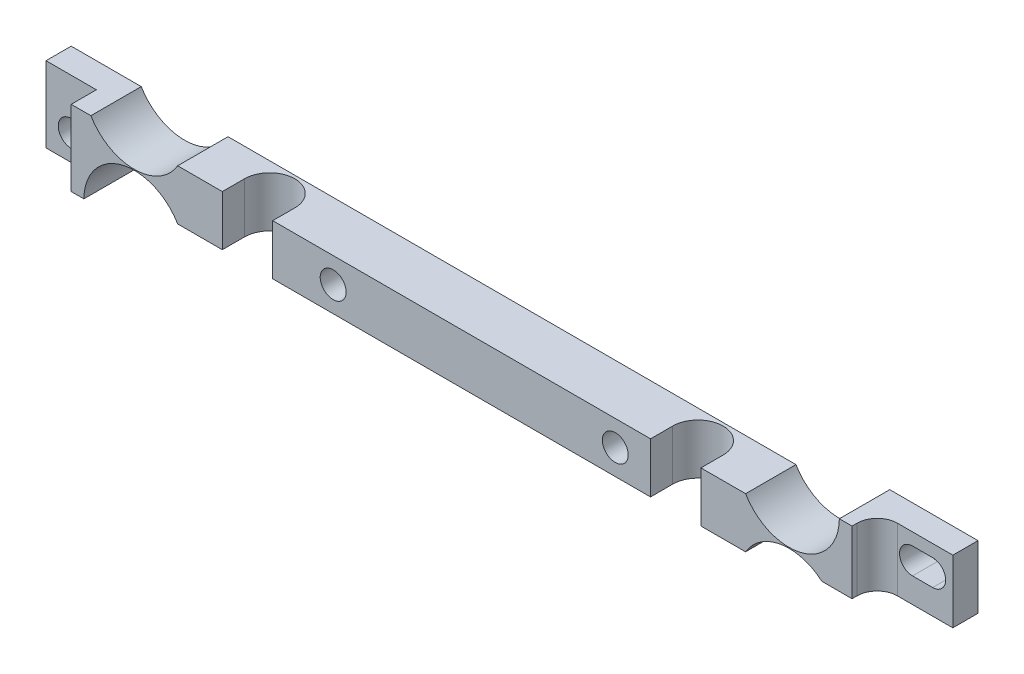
ISO-10303-21;
HEADER;
FILE_DESCRIPTION(('STEP AP214'),'2;1');
FILE_NAME('part.step','',(''),(''),'','','');
FILE_SCHEMA(('AUTOMOTIVE_DESIGN { 1 0 10303 214 1 1 1 1 }'));
ENDSEC;
DATA;
#1=APPLICATION_CONTEXT('core data for automotive mechanical design processes');
#2=APPLICATION_PROTOCOL_DEFINITION('international standard','automotive_design',2000,#1);
#3=PRODUCT_CONTEXT('',#1,'mechanical');
#4=PRODUCT('Part','Part','',(#3));
#5=PRODUCT_RELATED_PRODUCT_CATEGORY('part','',(#4));
#6=PRODUCT_DEFINITION_FORMATION('','',#4);
#7=PRODUCT_DEFINITION_CONTEXT('part definition',#1,'design');
#8=PRODUCT_DEFINITION('design','',#6,#7);
#9=PRODUCT_DEFINITION_SHAPE('','',#8);
#10=(LENGTH_UNIT() NAMED_UNIT(*) SI_UNIT(.MILLI.,.METRE.));
#11=(NAMED_UNIT(*) PLANE_ANGLE_UNIT() SI_UNIT($,.RADIAN.));
#12=(NAMED_UNIT(*) SI_UNIT($,.STERADIAN.) SOLID_ANGLE_UNIT());
#13=UNCERTAINTY_MEASURE_WITH_UNIT(LENGTH_MEASURE(1.E-05),#10,'distance_accuracy_value','');
#14=(GEOMETRIC_REPRESENTATION_CONTEXT(3) GLOBAL_UNCERTAINTY_ASSIGNED_CONTEXT((#13)) GLOBAL_UNIT_ASSIGNED_CONTEXT((#10,
#11,#12)) REPRESENTATION_CONTEXT('',''));
#15=CARTESIAN_POINT('',(0.,0.,0.));
#16=DIRECTION('',(0.,0.,1.));
#17=DIRECTION('',(1.,0.,0.));
#18=AXIS2_PLACEMENT_3D('',#15,#16,#17);
#19=CARTESIAN_POINT('',(-32.4430669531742,6.35000000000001,6.35));
#20=DIRECTION('',(0.,0.,-1.));
#21=DIRECTION('',(-1.,0.,0.));
#22=AXIS2_PLACEMENT_3D('',#19,#20,#21);
#23=PLANE('',#22);
#24=DIRECTION('',(0.,-1.,0.));
#25=VECTOR('',#24,1.);
#26=CARTESIAN_POINT('',(85.725,12.7,6.35));
#27=LINE('',#26,#25);
#28=CARTESIAN_POINT('',(85.725,9.525,6.35));
#29=VERTEX_POINT('',#28);
#30=CARTESIAN_POINT('',(85.725,3.17499999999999,6.35));
#31=VERTEX_POINT('',#30);
#32=EDGE_CURVE('E248',#29,#31,#27,.T.);
#33=ORIENTED_EDGE('',*,*,#32,.T.);
#34=DIRECTION('',(1.,0.,0.));
#35=VECTOR('',#34,1.);
#36=CARTESIAN_POINT('',(-32.4430669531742,3.17499999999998,6.35));
#37=LINE('',#36,#35);
#38=CARTESIAN_POINT('',(91.3551826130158,3.175,6.35));
#39=VERTEX_POINT('',#38);
#40=EDGE_CURVE('E336',#31,#39,#37,.T.);
#41=ORIENTED_EDGE('',*,*,#40,.T.);
#42=CARTESIAN_POINT('',(96.8248,-0.0508000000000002,6.35));
#43=DIRECTION('',(0.,0.,-1.));
#44=DIRECTION('',(-1.,0.,0.));
#45=AXIS2_PLACEMENT_3D('',#42,#43,#44);
#46=CIRCLE('',#45,6.35);
#47=CARTESIAN_POINT('',(100.966616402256,4.7625,6.35));
#48=VERTEX_POINT('',#47);
#49=EDGE_CURVE('E340',#39,#48,#46,.T.);
#50=ORIENTED_EDGE('',*,*,#49,.T.);
#51=DIRECTION('',(1.,0.,0.));
#52=VECTOR('',#51,1.);
#53=CARTESIAN_POINT('',(114.3,4.7625,6.35));
#54=LINE('',#53,#52);
#55=CARTESIAN_POINT('',(104.775,4.7625,6.35));
#56=VERTEX_POINT('',#55);
#57=EDGE_CURVE('E321',#48,#56,#54,.T.);
#58=ORIENTED_EDGE('',*,*,#57,.T.);
#59=DIRECTION('',(0.,-1.,0.));
#60=VECTOR('',#59,1.);
#61=CARTESIAN_POINT('',(104.775,12.7,6.35));
#62=LINE('',#61,#60);
#63=CARTESIAN_POINT('',(104.775,12.7,6.35));
#64=VERTEX_POINT('',#63);
#65=EDGE_CURVE('E278',#64,#56,#62,.T.);
#66=ORIENTED_EDGE('',*,*,#65,.F.);
#67=DIRECTION('',(1.,0.,0.));
#68=VECTOR('',#67,1.);
#69=CARTESIAN_POINT('',(-32.4430669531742,12.7,6.35));
#70=LINE('',#69,#68);
#71=CARTESIAN_POINT('',(103.174596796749,12.7,6.35));
#72=VERTEX_POINT('',#71);
#73=EDGE_CURVE('E344',#72,#64,#70,.T.);
#74=ORIENTED_EDGE('',*,*,#73,.F.);
#75=CARTESIAN_POINT('',(96.8248,12.7508,6.35));
#76=DIRECTION('',(0.,0.,-1.));
#77=DIRECTION('',(-1.,0.,0.));
#78=AXIS2_PLACEMENT_3D('',#75,#76,#77);
#79=CIRCLE('',#78,6.35);
#80=CARTESIAN_POINT('',(91.3551826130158,9.525,6.35));
#81=VERTEX_POINT('',#80);
#82=EDGE_CURVE('E347',#72,#81,#79,.T.);
#83=ORIENTED_EDGE('',*,*,#82,.T.);
#84=DIRECTION('',(1.,0.,0.));
#85=VECTOR('',#84,1.);
#86=CARTESIAN_POINT('',(-32.4430669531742,9.52499999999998,6.35));
#87=LINE('',#86,#85);
#88=EDGE_CURVE('E350',#29,#81,#87,.T.);
#89=ORIENTED_EDGE('',*,*,#88,.F.);
#90=EDGE_LOOP('',(#33,#41,#50,#58,#66,#74,#83,#89));
#91=FACE_BOUND('',#90,.T.);
#92=ADVANCED_FACE('F30',(#91),#23,.F.);
#93=CARTESIAN_POINT('',(74.93,6.35,6.35));
#94=DIRECTION('',(0.,0.,1.));
#95=DIRECTION('',(1.,0.,0.));
#96=AXIS2_PLACEMENT_3D('',#93,#94,#95);
#97=CIRCLE('',#96,1.63194999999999);
#98=CARTESIAN_POINT('',(76.56195,6.35,6.35));
#99=VERTEX_POINT('',#98);
#100=EDGE_CURVE('E828',#99,#99,#97,.T.);
#101=ORIENTED_EDGE('',*,*,#100,.F.);
#102=EDGE_LOOP('',(#101));
#103=FACE_BOUND('',#102,.T.);
#104=CARTESIAN_POINT('',(39.37,6.35,6.35));
#105=DIRECTION('',(0.,0.,1.));
#106=DIRECTION('',(1.,0.,0.));
#107=AXIS2_PLACEMENT_3D('',#104,#105,#106);
#108=CIRCLE('',#107,1.63195);
#109=CARTESIAN_POINT('',(41.00195,6.35,6.35));
#110=VERTEX_POINT('',#109);
#111=EDGE_CURVE('E830',#110,#110,#108,.T.);
#112=ORIENTED_EDGE('',*,*,#111,.F.);
#113=EDGE_LOOP('',(#112));
#114=FACE_BOUND('',#113,.T.);
#115=CARTESIAN_POINT('',(31.75,3.17499999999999,6.35));
#116=VERTEX_POINT('',#115);
#117=CARTESIAN_POINT('',(79.375,3.17499999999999,6.35));
#118=VERTEX_POINT('',#117);
#119=EDGE_CURVE('E341',#116,#118,#37,.T.);
#120=ORIENTED_EDGE('',*,*,#119,.T.);
#121=DIRECTION('',(0.,-1.,0.));
#122=VECTOR('',#121,1.);
#123=CARTESIAN_POINT('',(79.375,12.7,6.35));
#124=LINE('',#123,#122);
#125=CARTESIAN_POINT('',(79.375,9.525,6.35));
#126=VERTEX_POINT('',#125);
#127=EDGE_CURVE('E234',#126,#118,#124,.T.);
#128=ORIENTED_EDGE('',*,*,#127,.F.);
#129=CARTESIAN_POINT('',(31.75,9.52499999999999,6.35));
#130=VERTEX_POINT('',#129);
#131=EDGE_CURVE('E355',#130,#126,#87,.T.);
#132=ORIENTED_EDGE('',*,*,#131,.F.);
#133=DIRECTION('',(0.,1.,0.));
#134=VECTOR('',#133,1.);
#135=CARTESIAN_POINT('',(31.75,6.35000000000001,6.35));
#136=LINE('',#135,#134);
#137=EDGE_CURVE('E440',#116,#130,#136,.T.);
#138=ORIENTED_EDGE('',*,*,#137,.F.);
#139=EDGE_LOOP('',(#120,#128,#132,#138));
#140=FACE_BOUND('',#139,.T.);
#141=ADVANCED_FACE('F462',(#103,#114,#140),#23,.F.);
#142=CARTESIAN_POINT('',(-32.4430669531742,7.89304999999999,6.35));
#143=DIRECTION('',(0.,-1.,0.));
#144=DIRECTION('',(0.,0.,-1.));
#145=AXIS2_PLACEMENT_3D('',#142,#143,#144);
#146=PLANE('',#145);
#147=DIRECTION('',(0.,0.,-1.));
#148=VECTOR('',#147,1.);
#149=CARTESIAN_POINT('',(109.22,7.89304999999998,6.35));
#150=LINE('',#149,#148);
#151=CARTESIAN_POINT('',(109.22,7.89304999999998,3.175));
#152=VERTEX_POINT('',#151);
#153=CARTESIAN_POINT('',(109.22,7.89304999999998,0.));
#154=VERTEX_POINT('',#153);
#155=EDGE_CURVE('E411',#152,#154,#150,.T.);
#156=ORIENTED_EDGE('',*,*,#155,.F.);
#157=DIRECTION('',(1.,0.,0.));
#158=VECTOR('',#157,1.);
#159=CARTESIAN_POINT('',(-32.4430669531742,7.89304999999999,3.17499999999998));
#160=LINE('',#159,#158);
#161=CARTESIAN_POINT('',(111.76,7.89304999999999,3.175));
#162=VERTEX_POINT('',#161);
#163=EDGE_CURVE('E302',#152,#162,#160,.T.);
#164=ORIENTED_EDGE('',*,*,#163,.T.);
#165=DIRECTION('',(0.,0.,-1.));
#166=VECTOR('',#165,1.);
#167=CARTESIAN_POINT('',(111.76,7.89304999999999,6.35));
#168=LINE('',#167,#166);
#169=CARTESIAN_POINT('',(111.76,7.89304999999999,0.));
#170=VERTEX_POINT('',#169);
#171=EDGE_CURVE('E404',#162,#170,#168,.T.);
#172=ORIENTED_EDGE('',*,*,#171,.T.);
#173=DIRECTION('',(-1.,0.,0.));
#174=VECTOR('',#173,1.);
#175=CARTESIAN_POINT('',(-32.4430669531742,7.89304999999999,0.));
#176=LINE('',#175,#174);
#177=EDGE_CURVE('E390',#170,#154,#176,.T.);
#178=ORIENTED_EDGE('',*,*,#177,.T.);
#179=EDGE_LOOP('',(#156,#164,#172,#178));
#180=FACE_BOUND('',#179,.T.);
#181=ADVANCED_FACE('F539',(#180),#146,.F.);
#182=CARTESIAN_POINT('',(109.22,9.52499999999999,6.35));
#183=DIRECTION('',(0.,0.,-1.));
#184=DIRECTION('',(-1.,0.,0.));
#185=AXIS2_PLACEMENT_3D('',#182,#183,#184);
#186=CYLINDRICAL_SURFACE('',#185,1.63195);
#187=DIRECTION('',(0.,0.,-1.));
#188=VECTOR('',#187,1.);
#189=CARTESIAN_POINT('',(109.22,11.15695,6.35));
#190=LINE('',#189,#188);
#191=CARTESIAN_POINT('',(109.22,11.15695,3.175));
#192=VERTEX_POINT('',#191);
#193=CARTESIAN_POINT('',(109.22,11.15695,0.));
#194=VERTEX_POINT('',#193);
#195=EDGE_CURVE('E409',#192,#194,#190,.T.);
#196=ORIENTED_EDGE('',*,*,#195,.F.);
#197=CARTESIAN_POINT('',(109.22,9.52499999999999,3.175));
#198=DIRECTION('',(0.,0.,-1.));
#199=DIRECTION('',(-1.,0.,0.));
#200=AXIS2_PLACEMENT_3D('',#197,#198,#199);
#201=CIRCLE('',#200,1.63195);
#202=EDGE_CURVE('E299',#192,#152,#201,.F.);
#203=ORIENTED_EDGE('',*,*,#202,.T.);
#204=ORIENTED_EDGE('',*,*,#155,.T.);
#205=CARTESIAN_POINT('',(109.22,9.52499999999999,0.));
#206=DIRECTION('',(0.,0.,-1.));
#207=DIRECTION('',(-1.,0.,0.));
#208=AXIS2_PLACEMENT_3D('',#205,#206,#207);
#209=CIRCLE('',#208,1.63195);
#210=EDGE_CURVE('E393',#154,#194,#209,.T.);
#211=ORIENTED_EDGE('',*,*,#210,.T.);
#212=EDGE_LOOP('',(#196,#203,#204,#211));
#213=FACE_BOUND('',#212,.T.);
#214=ADVANCED_FACE('F567',(#213),#186,.F.);
#215=CARTESIAN_POINT('',(-32.4430669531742,11.1569499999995,6.35));
#216=DIRECTION('',(0.,1.,0.));
#217=DIRECTION('',(-1.,0.,0.));
#218=AXIS2_PLACEMENT_3D('',#215,#216,#217);
#219=PLANE('',#218);
#220=DIRECTION('',(0.,0.,-1.));
#221=VECTOR('',#220,1.);
#222=CARTESIAN_POINT('',(111.76,11.15695,6.35));
#223=LINE('',#222,#221);
#224=CARTESIAN_POINT('',(111.76,11.15695,3.175));
#225=VERTEX_POINT('',#224);
#226=CARTESIAN_POINT('',(111.76,11.15695,0.));
#227=VERTEX_POINT('',#226);
#228=EDGE_CURVE('E406',#225,#227,#223,.T.);
#229=ORIENTED_EDGE('',*,*,#228,.F.);
#230=DIRECTION('',(-1.,0.,0.));
#231=VECTOR('',#230,1.);
#232=CARTESIAN_POINT('',(-32.4430669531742,11.1569499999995,3.17499999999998));
#233=LINE('',#232,#231);
#234=EDGE_CURVE('E296',#225,#192,#233,.T.);
#235=ORIENTED_EDGE('',*,*,#234,.T.);
#236=ORIENTED_EDGE('',*,*,#195,.T.);
#237=DIRECTION('',(1.,0.,0.));
#238=VECTOR('',#237,1.);
#239=CARTESIAN_POINT('',(-32.4430669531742,11.1569499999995,0.));
#240=LINE('',#239,#238);
#241=EDGE_CURVE('E396',#194,#227,#240,.T.);
#242=ORIENTED_EDGE('',*,*,#241,.T.);
#243=EDGE_LOOP('',(#229,#235,#236,#242));
#244=FACE_BOUND('',#243,.T.);
#245=ADVANCED_FACE('F564',(#244),#219,.F.);
#246=CARTESIAN_POINT('',(-32.4430669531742,0.,6.35));
#247=DIRECTION('',(0.,-1.,0.));
#248=DIRECTION('',(0.,0.,-1.));
#249=AXIS2_PLACEMENT_3D('',#246,#247,#248);
#250=PLANE('',#249);
#251=DIRECTION('',(0.,0.,1.));
#252=VECTOR('',#251,1.);
#253=CARTESIAN_POINT('',(6.35,0.,6.35));
#254=LINE('',#253,#252);
#255=CARTESIAN_POINT('',(6.35,0.,3.175));
#256=VERTEX_POINT('',#255);
#257=CARTESIAN_POINT('',(6.35,0.,6.35));
#258=VERTEX_POINT('',#257);
#259=EDGE_CURVE('E308',#256,#258,#254,.T.);
#260=ORIENTED_EDGE('',*,*,#259,.F.);
#261=DIRECTION('',(1.,0.,0.));
#262=VECTOR('',#261,1.);
#263=CARTESIAN_POINT('',(0.,0.,3.175));
#264=LINE('',#263,#262);
#265=CARTESIAN_POINT('',(0.,0.,3.175));
#266=VERTEX_POINT('',#265);
#267=EDGE_CURVE('E305',#266,#256,#264,.T.);
#268=ORIENTED_EDGE('',*,*,#267,.F.);
#269=DIRECTION('',(0.,0.,-1.));
#270=VECTOR('',#269,1.);
#271=CARTESIAN_POINT('',(0.,0.,6.35));
#272=LINE('',#271,#270);
#273=CARTESIAN_POINT('',(0.,0.,0.));
#274=VERTEX_POINT('',#273);
#275=EDGE_CURVE('E360',#266,#274,#272,.T.);
#276=ORIENTED_EDGE('',*,*,#275,.T.);
#277=DIRECTION('',(-1.,0.,0.));
#278=VECTOR('',#277,1.);
#279=CARTESIAN_POINT('',(-32.4430669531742,0.,0.));
#280=LINE('',#279,#278);
#281=CARTESIAN_POINT('',(7.9504032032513,0.,0.));
#282=VERTEX_POINT('',#281);
#283=EDGE_CURVE('E329',#282,#274,#280,.T.);
#284=ORIENTED_EDGE('',*,*,#283,.F.);
#285=DIRECTION('',(0.,0.,-1.));
#286=VECTOR('',#285,1.);
#287=CARTESIAN_POINT('',(7.9504032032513,0.,6.35));
#288=LINE('',#287,#286);
#289=CARTESIAN_POINT('',(7.9504032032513,0.,6.35));
#290=VERTEX_POINT('',#289);
#291=EDGE_CURVE('E407',#290,#282,#288,.T.);
#292=ORIENTED_EDGE('',*,*,#291,.F.);
#293=DIRECTION('',(-1.,0.,0.));
#294=VECTOR('',#293,1.);
#295=CARTESIAN_POINT('',(-32.4430669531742,0.,6.35));
#296=LINE('',#295,#294);
#297=EDGE_CURVE('E330',#290,#258,#296,.T.);
#298=ORIENTED_EDGE('',*,*,#297,.T.);
#299=EDGE_LOOP('',(#260,#268,#276,#284,#292,#298));
#300=FACE_BOUND('',#299,.T.);
#301=ADVANCED_FACE('F32',(#300),#250,.T.);
#302=CARTESIAN_POINT('',(14.3002,-0.0508000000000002,6.35));
#303=DIRECTION('',(0.,0.,-1.));
#304=DIRECTION('',(-1.,0.,0.));
#305=AXIS2_PLACEMENT_3D('',#302,#303,#304);
#306=CYLINDRICAL_SURFACE('',#305,6.35);
#307=CARTESIAN_POINT('',(14.3002,-0.0508000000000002,0.));
#308=DIRECTION('',(0.,0.,-1.));
#309=DIRECTION('',(-1.,0.,0.));
#310=AXIS2_PLACEMENT_3D('',#307,#308,#309);
#311=CIRCLE('',#310,6.35);
#312=CARTESIAN_POINT('',(19.7698173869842,3.17499999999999,0.));
#313=VERTEX_POINT('',#312);
#314=EDGE_CURVE('E363',#282,#313,#311,.T.);
#315=ORIENTED_EDGE('',*,*,#314,.T.);
#316=DIRECTION('',(0.,0.,-1.));
#317=VECTOR('',#316,1.);
#318=CARTESIAN_POINT('',(19.7698173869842,3.17499999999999,6.35));
#319=LINE('',#318,#317);
#320=CARTESIAN_POINT('',(19.7698173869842,3.17499999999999,6.35));
#321=VERTEX_POINT('',#320);
#322=EDGE_CURVE('E431',#321,#313,#319,.T.);
#323=ORIENTED_EDGE('',*,*,#322,.F.);
#324=CARTESIAN_POINT('',(14.3002,-0.0508000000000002,6.35));
#325=DIRECTION('',(0.,0.,-1.));
#326=DIRECTION('',(-1.,0.,0.));
#327=AXIS2_PLACEMENT_3D('',#324,#325,#326);
#328=CIRCLE('',#327,6.35);
#329=EDGE_CURVE('E333',#290,#321,#328,.T.);
#330=ORIENTED_EDGE('',*,*,#329,.F.);
#331=ORIENTED_EDGE('',*,*,#291,.T.);
#332=EDGE_LOOP('',(#315,#323,#330,#331));
#333=FACE_BOUND('',#332,.T.);
#334=ADVANCED_FACE('F589',(#333),#306,.F.);
#335=CARTESIAN_POINT('',(-32.4430669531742,3.17499999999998,6.35));
#336=DIRECTION('',(0.,1.,0.));
#337=DIRECTION('',(-1.,0.,0.));
#338=AXIS2_PLACEMENT_3D('',#335,#336,#337);
#339=PLANE('',#338);
#340=CARTESIAN_POINT('',(82.55,3.17499999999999,3.556));
#341=DIRECTION('',(0.,1.,0.));
#342=DIRECTION('',(0.,0.,1.));
#343=AXIS2_PLACEMENT_3D('',#340,#341,#342);
#344=CIRCLE('',#343,3.175);
#345=CARTESIAN_POINT('',(85.725,3.17499999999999,3.556));
#346=VERTEX_POINT('',#345);
#347=CARTESIAN_POINT('',(79.375,3.17499999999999,3.556));
#348=VERTEX_POINT('',#347);
#349=EDGE_CURVE('E222',#346,#348,#344,.T.);
#350=ORIENTED_EDGE('',*,*,#349,.T.);
#351=DIRECTION('',(0.,0.,-1.));
#352=VECTOR('',#351,1.);
#353=CARTESIAN_POINT('',(79.375,3.17499999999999,3.175));
#354=LINE('',#353,#352);
#355=EDGE_CURVE('E231',#118,#348,#354,.T.);
#356=ORIENTED_EDGE('',*,*,#355,.F.);
#357=ORIENTED_EDGE('',*,*,#119,.F.);
#358=DIRECTION('',(0.,0.,-1.));
#359=VECTOR('',#358,1.);
#360=CARTESIAN_POINT('',(31.75,3.17499999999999,3.175));
#361=LINE('',#360,#359);
#362=CARTESIAN_POINT('',(31.75,3.17499999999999,3.556));
#363=VERTEX_POINT('',#362);
#364=EDGE_CURVE('E53',#116,#363,#361,.T.);
#365=ORIENTED_EDGE('',*,*,#364,.T.);
#366=CARTESIAN_POINT('',(28.575,3.17499999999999,3.556));
#367=DIRECTION('',(0.,1.,0.));
#368=DIRECTION('',(0.,0.,1.));
#369=AXIS2_PLACEMENT_3D('',#366,#367,#368);
#370=CIRCLE('',#369,3.175);
#371=CARTESIAN_POINT('',(25.4,3.17499999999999,3.556));
#372=VERTEX_POINT('',#371);
#373=EDGE_CURVE('E254',#363,#372,#370,.T.);
#374=ORIENTED_EDGE('',*,*,#373,.T.);
#375=DIRECTION('',(0.,0.,-1.));
#376=VECTOR('',#375,1.);
#377=CARTESIAN_POINT('',(25.4,3.17499999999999,3.175));
#378=LINE('',#377,#376);
#379=CARTESIAN_POINT('',(25.4,3.17499999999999,6.35));
#380=VERTEX_POINT('',#379);
#381=EDGE_CURVE('E247',#380,#372,#378,.T.);
#382=ORIENTED_EDGE('',*,*,#381,.F.);
#383=EDGE_CURVE('E337',#321,#380,#37,.T.);
#384=ORIENTED_EDGE('',*,*,#383,.F.);
#385=ORIENTED_EDGE('',*,*,#322,.T.);
#386=DIRECTION('',(1.,0.,0.));
#387=VECTOR('',#386,1.);
#388=CARTESIAN_POINT('',(-32.4430669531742,3.17499999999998,0.));
#389=LINE('',#388,#387);
#390=CARTESIAN_POINT('',(91.3551826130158,3.175,0.));
#391=VERTEX_POINT('',#390);
#392=EDGE_CURVE('E365',#313,#391,#389,.T.);
#393=ORIENTED_EDGE('',*,*,#392,.T.);
#394=DIRECTION('',(0.,0.,-1.));
#395=VECTOR('',#394,1.);
#396=CARTESIAN_POINT('',(91.3551826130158,3.175,6.35));
#397=LINE('',#396,#395);
#398=EDGE_CURVE('E428',#39,#391,#397,.T.);
#399=ORIENTED_EDGE('',*,*,#398,.F.);
#400=ORIENTED_EDGE('',*,*,#40,.F.);
#401=DIRECTION('',(0.,0.,-1.));
#402=VECTOR('',#401,1.);
#403=CARTESIAN_POINT('',(85.725,3.17499999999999,3.175));
#404=LINE('',#403,#402);
#405=EDGE_CURVE('E228',#31,#346,#404,.T.);
#406=ORIENTED_EDGE('',*,*,#405,.T.);
#407=EDGE_LOOP('',(#350,#356,#357,#365,#374,#382,#384,#385,#393,#399,#400,#406));
#408=FACE_BOUND('',#407,.T.);
#409=ADVANCED_FACE('F240',(#408),#339,.F.);
#410=CARTESIAN_POINT('',(96.8248,-0.0508000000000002,6.35));
#411=DIRECTION('',(0.,0.,-1.));
#412=DIRECTION('',(-1.,0.,0.));
#413=AXIS2_PLACEMENT_3D('',#410,#411,#412);
#414=CYLINDRICAL_SURFACE('',#413,6.35);
#415=CARTESIAN_POINT('',(96.8248,-0.0508000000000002,0.));
#416=DIRECTION('',(0.,0.,-1.));
#417=DIRECTION('',(-1.,0.,0.));
#418=AXIS2_PLACEMENT_3D('',#415,#416,#417);
#419=CIRCLE('',#418,6.35);
#420=CARTESIAN_POINT('',(100.966616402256,4.7625,0.));
#421=VERTEX_POINT('',#420);
#422=EDGE_CURVE('E367',#391,#421,#419,.T.);
#423=ORIENTED_EDGE('',*,*,#422,.T.);
#424=DIRECTION('',(0.,0.,-1.));
#425=VECTOR('',#424,1.);
#426=CARTESIAN_POINT('',(100.966616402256,4.7625,6.35));
#427=LINE('',#426,#425);
#428=EDGE_CURVE('E326',#421,#48,#427,.F.);
#429=ORIENTED_EDGE('',*,*,#428,.T.);
#430=ORIENTED_EDGE('',*,*,#49,.F.);
#431=ORIENTED_EDGE('',*,*,#398,.T.);
#432=EDGE_LOOP('',(#423,#429,#430,#431));
#433=FACE_BOUND('',#432,.T.);
#434=ADVANCED_FACE('F468',(#433),#414,.F.);
#435=CARTESIAN_POINT('',(114.3,6.35000000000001,6.35));
#436=DIRECTION('',(-1.,0.,0.));
#437=DIRECTION('',(0.,0.,1.));
#438=AXIS2_PLACEMENT_3D('',#435,#436,#437);
#439=PLANE('',#438);
#440=DIRECTION('',(0.,0.,-1.));
#441=VECTOR('',#440,1.);
#442=CARTESIAN_POINT('',(114.3,12.7,6.35));
#443=LINE('',#442,#441);
#444=CARTESIAN_POINT('',(114.3,12.7,3.175));
#445=VERTEX_POINT('',#444);
#446=CARTESIAN_POINT('',(114.3,12.7,0.));
#447=VERTEX_POINT('',#446);
#448=EDGE_CURVE('E426',#445,#447,#443,.T.);
#449=ORIENTED_EDGE('',*,*,#448,.F.);
#450=DIRECTION('',(0.,-1.,0.));
#451=VECTOR('',#450,1.);
#452=CARTESIAN_POINT('',(114.3,12.7,3.175));
#453=LINE('',#452,#451);
#454=CARTESIAN_POINT('',(114.3,4.7625,3.175));
#455=VERTEX_POINT('',#454);
#456=EDGE_CURVE('E285',#445,#455,#453,.T.);
#457=ORIENTED_EDGE('',*,*,#456,.T.);
#458=DIRECTION('',(0.,0.,-1.));
#459=VECTOR('',#458,1.);
#460=CARTESIAN_POINT('',(114.3,4.7625,6.35));
#461=LINE('',#460,#459);
#462=CARTESIAN_POINT('',(114.3,4.7625,0.));
#463=VERTEX_POINT('',#462);
#464=EDGE_CURVE('E324',#455,#463,#461,.T.);
#465=ORIENTED_EDGE('',*,*,#464,.T.);
#466=DIRECTION('',(0.,1.,0.));
#467=VECTOR('',#466,1.);
#468=CARTESIAN_POINT('',(114.3,6.35000000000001,0.));
#469=LINE('',#468,#467);
#470=EDGE_CURVE('E370',#463,#447,#469,.T.);
#471=ORIENTED_EDGE('',*,*,#470,.T.);
#472=EDGE_LOOP('',(#449,#457,#465,#471));
#473=FACE_BOUND('',#472,.T.);
#474=ADVANCED_FACE('F482',(#473),#439,.F.);
#475=CARTESIAN_POINT('',(-32.4430669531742,12.7,6.35));
#476=DIRECTION('',(0.,1.,0.));
#477=DIRECTION('',(0.,0.,1.));
#478=AXIS2_PLACEMENT_3D('',#475,#476,#477);
#479=PLANE('',#478);
#480=DIRECTION('',(1.,0.,0.));
#481=VECTOR('',#480,1.);
#482=CARTESIAN_POINT('',(114.3,12.7,3.175));
#483=LINE('',#482,#481);
#484=CARTESIAN_POINT('',(107.315,12.7,3.175));
#485=VERTEX_POINT('',#484);
#486=EDGE_CURVE('E275',#485,#445,#483,.T.);
#487=ORIENTED_EDGE('',*,*,#486,.T.);
#488=ORIENTED_EDGE('',*,*,#448,.T.);
#489=DIRECTION('',(1.,0.,0.));
#490=VECTOR('',#489,1.);
#491=CARTESIAN_POINT('',(-32.4430669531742,12.7,0.));
#492=LINE('',#491,#490);
#493=CARTESIAN_POINT('',(103.174596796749,12.7,0.));
#494=VERTEX_POINT('',#493);
#495=EDGE_CURVE('E373',#494,#447,#492,.T.);
#496=ORIENTED_EDGE('',*,*,#495,.F.);
#497=DIRECTION('',(0.,0.,-1.));
#498=VECTOR('',#497,1.);
#499=CARTESIAN_POINT('',(103.174596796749,12.7,6.35));
#500=LINE('',#499,#498);
#501=EDGE_CURVE('E424',#72,#494,#500,.T.);
#502=ORIENTED_EDGE('',*,*,#501,.F.);
#503=ORIENTED_EDGE('',*,*,#73,.T.);
#504=DIRECTION('',(0.,0.,-1.));
#505=VECTOR('',#504,1.);
#506=CARTESIAN_POINT('',(104.775,12.7,6.35));
#507=LINE('',#506,#505);
#508=CARTESIAN_POINT('',(104.775,12.7,5.715));
#509=VERTEX_POINT('',#508);
#510=EDGE_CURVE('E268',#64,#509,#507,.T.);
#511=ORIENTED_EDGE('',*,*,#510,.T.);
#512=CARTESIAN_POINT('',(107.315,12.7,5.715));
#513=DIRECTION('',(0.,-1.,0.));
#514=DIRECTION('',(0.,0.,1.));
#515=AXIS2_PLACEMENT_3D('',#512,#513,#514);
#516=CIRCLE('',#515,2.54);
#517=EDGE_CURVE('E271',#509,#485,#516,.T.);
#518=ORIENTED_EDGE('',*,*,#517,.T.);
#519=EDGE_LOOP('',(#487,#488,#496,#502,#503,#511,#518));
#520=FACE_BOUND('',#519,.T.);
#521=ADVANCED_FACE('F496',(#520),#479,.T.);
#522=CARTESIAN_POINT('',(96.8248,12.7508,6.35));
#523=DIRECTION('',(0.,0.,-1.));
#524=DIRECTION('',(-1.,0.,0.));
#525=AXIS2_PLACEMENT_3D('',#522,#523,#524);
#526=CYLINDRICAL_SURFACE('',#525,6.35);
#527=CARTESIAN_POINT('',(96.8248,12.7508,0.));
#528=DIRECTION('',(0.,0.,-1.));
#529=DIRECTION('',(-1.,0.,0.));
#530=AXIS2_PLACEMENT_3D('',#527,#528,#529);
#531=CIRCLE('',#530,6.35);
#532=CARTESIAN_POINT('',(91.3551826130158,9.525,0.));
#533=VERTEX_POINT('',#532);
#534=EDGE_CURVE('E376',#494,#533,#531,.T.);
#535=ORIENTED_EDGE('',*,*,#534,.T.);
#536=DIRECTION('',(0.,0.,-1.));
#537=VECTOR('',#536,1.);
#538=CARTESIAN_POINT('',(91.3551826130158,9.525,6.35));
#539=LINE('',#538,#537);
#540=EDGE_CURVE('E422',#81,#533,#539,.T.);
#541=ORIENTED_EDGE('',*,*,#540,.F.);
#542=ORIENTED_EDGE('',*,*,#82,.F.);
#543=ORIENTED_EDGE('',*,*,#501,.T.);
#544=EDGE_LOOP('',(#535,#541,#542,#543));
#545=FACE_BOUND('',#544,.T.);
#546=ADVANCED_FACE('F498',(#545),#526,.F.);
#547=CARTESIAN_POINT('',(-32.4430669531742,9.52499999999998,6.35));
#548=DIRECTION('',(0.,1.,0.));
#549=DIRECTION('',(-1.,0.,0.));
#550=AXIS2_PLACEMENT_3D('',#547,#548,#549);
#551=PLANE('',#550);
#552=DIRECTION('',(0.,0.,1.));
#553=VECTOR('',#552,1.);
#554=CARTESIAN_POINT('',(79.375,9.525,6.35));
#555=LINE('',#554,#553);
#556=CARTESIAN_POINT('',(79.375,9.525,3.556));
#557=VERTEX_POINT('',#556);
#558=EDGE_CURVE('E11',#557,#126,#555,.T.);
#559=ORIENTED_EDGE('',*,*,#558,.F.);
#560=CARTESIAN_POINT('',(82.55,9.525,3.556));
#561=DIRECTION('',(0.,1.,0.));
#562=DIRECTION('',(-1.,0.,0.));
#563=AXIS2_PLACEMENT_3D('',#560,#561,#562);
#564=CIRCLE('',#563,3.175);
#565=CARTESIAN_POINT('',(85.725,9.525,3.556));
#566=VERTEX_POINT('',#565);
#567=EDGE_CURVE('E225',#557,#566,#564,.F.);
#568=ORIENTED_EDGE('',*,*,#567,.T.);
#569=DIRECTION('',(0.,0.,1.));
#570=VECTOR('',#569,1.);
#571=CARTESIAN_POINT('',(85.725,9.525,6.35));
#572=LINE('',#571,#570);
#573=EDGE_CURVE('E38',#566,#29,#572,.T.);
#574=ORIENTED_EDGE('',*,*,#573,.T.);
#575=ORIENTED_EDGE('',*,*,#88,.T.);
#576=ORIENTED_EDGE('',*,*,#540,.T.);
#577=DIRECTION('',(1.,0.,0.));
#578=VECTOR('',#577,1.);
#579=CARTESIAN_POINT('',(-32.4430669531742,9.52499999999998,0.));
#580=LINE('',#579,#578);
#581=CARTESIAN_POINT('',(19.7698173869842,9.52499999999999,0.));
#582=VERTEX_POINT('',#581);
#583=EDGE_CURVE('E379',#582,#533,#580,.T.);
#584=ORIENTED_EDGE('',*,*,#583,.F.);
#585=DIRECTION('',(0.,0.,-1.));
#586=VECTOR('',#585,1.);
#587=CARTESIAN_POINT('',(19.7698173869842,9.52499999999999,6.35));
#588=LINE('',#587,#586);
#589=CARTESIAN_POINT('',(19.7698173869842,9.52499999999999,6.35));
#590=VERTEX_POINT('',#589);
#591=EDGE_CURVE('E420',#590,#582,#588,.T.);
#592=ORIENTED_EDGE('',*,*,#591,.F.);
#593=CARTESIAN_POINT('',(25.4,9.52499999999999,6.35));
#594=VERTEX_POINT('',#593);
#595=EDGE_CURVE('E351',#590,#594,#87,.T.);
#596=ORIENTED_EDGE('',*,*,#595,.T.);
#597=DIRECTION('',(0.,0.,1.));
#598=VECTOR('',#597,1.);
#599=CARTESIAN_POINT('',(25.4,9.52499999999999,6.35));
#600=LINE('',#599,#598);
#601=CARTESIAN_POINT('',(25.4,9.52499999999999,3.556));
#602=VERTEX_POINT('',#601);
#603=EDGE_CURVE('E265',#602,#594,#600,.T.);
#604=ORIENTED_EDGE('',*,*,#603,.F.);
#605=CARTESIAN_POINT('',(28.575,9.52499999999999,3.556));
#606=DIRECTION('',(0.,1.,0.));
#607=DIRECTION('',(-1.,0.,0.));
#608=AXIS2_PLACEMENT_3D('',#605,#606,#607);
#609=CIRCLE('',#608,3.175);
#610=CARTESIAN_POINT('',(31.75,9.52499999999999,3.556));
#611=VERTEX_POINT('',#610);
#612=EDGE_CURVE('E447',#602,#611,#609,.F.);
#613=ORIENTED_EDGE('',*,*,#612,.T.);
#614=DIRECTION('',(0.,0.,1.));
#615=VECTOR('',#614,1.);
#616=CARTESIAN_POINT('',(31.75,9.52499999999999,6.35));
#617=LINE('',#616,#615);
#618=EDGE_CURVE('E261',#611,#130,#617,.T.);
#619=ORIENTED_EDGE('',*,*,#618,.T.);
#620=ORIENTED_EDGE('',*,*,#131,.T.);
#621=EDGE_LOOP('',(#559,#568,#574,#575,#576,#584,#592,#596,#604,#613,#619,#620));
#622=FACE_BOUND('',#621,.T.);
#623=ADVANCED_FACE('F453',(#622),#551,.T.);
#624=CARTESIAN_POINT('',(14.3002,12.7508,6.35));
#625=DIRECTION('',(0.,0.,-1.));
#626=DIRECTION('',(-1.,0.,0.));
#627=AXIS2_PLACEMENT_3D('',#624,#625,#626);
#628=CYLINDRICAL_SURFACE('',#627,6.35);
#629=CARTESIAN_POINT('',(14.3002,12.7508,0.));
#630=DIRECTION('',(0.,0.,-1.));
#631=DIRECTION('',(-1.,0.,0.));
#632=AXIS2_PLACEMENT_3D('',#629,#630,#631);
#633=CIRCLE('',#632,6.35);
#634=CARTESIAN_POINT('',(8.83058261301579,9.52499999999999,0.));
#635=VERTEX_POINT('',#634);
#636=EDGE_CURVE('E382',#582,#635,#633,.T.);
#637=ORIENTED_EDGE('',*,*,#636,.T.);
#638=DIRECTION('',(0.,0.,-1.));
#639=VECTOR('',#638,1.);
#640=CARTESIAN_POINT('',(8.83058261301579,9.52499999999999,6.35));
#641=LINE('',#640,#639);
#642=CARTESIAN_POINT('',(8.83058261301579,9.52499999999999,6.35));
#643=VERTEX_POINT('',#642);
#644=EDGE_CURVE('E417',#643,#635,#641,.T.);
#645=ORIENTED_EDGE('',*,*,#644,.F.);
#646=CARTESIAN_POINT('',(14.3002,12.7508,6.35));
#647=DIRECTION('',(0.,0.,-1.));
#648=DIRECTION('',(-1.,0.,0.));
#649=AXIS2_PLACEMENT_3D('',#646,#647,#648);
#650=CIRCLE('',#649,6.35);
#651=EDGE_CURVE('E354',#590,#643,#650,.T.);
#652=ORIENTED_EDGE('',*,*,#651,.F.);
#653=ORIENTED_EDGE('',*,*,#591,.T.);
#654=EDGE_LOOP('',(#637,#645,#652,#653));
#655=FACE_BOUND('',#654,.T.);
#656=ADVANCED_FACE('F506',(#655),#628,.F.);
#657=CARTESIAN_POINT('',(-32.4430669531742,9.525,6.35));
#658=DIRECTION('',(0.,-1.,0.));
#659=DIRECTION('',(0.,0.,-1.));
#660=AXIS2_PLACEMENT_3D('',#657,#658,#659);
#661=PLANE('',#660);
#662=DIRECTION('',(1.,0.,0.));
#663=VECTOR('',#662,1.);
#664=CARTESIAN_POINT('',(-32.4430669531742,9.525,3.175));
#665=LINE('',#664,#663);
#666=CARTESIAN_POINT('',(0.,9.525,3.175));
#667=VERTEX_POINT('',#666);
#668=CARTESIAN_POINT('',(6.35,9.525,3.175));
#669=VERTEX_POINT('',#668);
#670=EDGE_CURVE('E318',#667,#669,#665,.T.);
#671=ORIENTED_EDGE('',*,*,#670,.T.);
#672=DIRECTION('',(0.,0.,1.));
#673=VECTOR('',#672,1.);
#674=CARTESIAN_POINT('',(6.35,9.525,6.35000000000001));
#675=LINE('',#674,#673);
#676=CARTESIAN_POINT('',(6.35,9.52499999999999,6.35));
#677=VERTEX_POINT('',#676);
#678=EDGE_CURVE('E313',#669,#677,#675,.T.);
#679=ORIENTED_EDGE('',*,*,#678,.T.);
#680=DIRECTION('',(-1.,0.,0.));
#681=VECTOR('',#680,1.);
#682=CARTESIAN_POINT('',(-32.4430669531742,9.525,6.35));
#683=LINE('',#682,#681);
#684=EDGE_CURVE('E357',#643,#677,#683,.T.);
#685=ORIENTED_EDGE('',*,*,#684,.F.);
#686=ORIENTED_EDGE('',*,*,#644,.T.);
#687=DIRECTION('',(-1.,0.,0.));
#688=VECTOR('',#687,1.);
#689=CARTESIAN_POINT('',(-32.4430669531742,9.525,0.));
#690=LINE('',#689,#688);
#691=CARTESIAN_POINT('',(0.,9.525,0.));
#692=VERTEX_POINT('',#691);
#693=EDGE_CURVE('E384',#635,#692,#690,.T.);
#694=ORIENTED_EDGE('',*,*,#693,.T.);
#695=DIRECTION('',(0.,0.,-1.));
#696=VECTOR('',#695,1.);
#697=CARTESIAN_POINT('',(0.,9.525,6.35));
#698=LINE('',#697,#696);
#699=EDGE_CURVE('E415',#667,#692,#698,.T.);
#700=ORIENTED_EDGE('',*,*,#699,.F.);
#701=EDGE_LOOP('',(#671,#679,#685,#686,#694,#700));
#702=FACE_BOUND('',#701,.T.);
#703=ADVANCED_FACE('F509',(#702),#661,.F.);
#704=CARTESIAN_POINT('',(111.76,9.525,6.35));
#705=DIRECTION('',(0.,0.,-1.));
#706=DIRECTION('',(-1.,0.,0.));
#707=AXIS2_PLACEMENT_3D('',#704,#705,#706);
#708=CYLINDRICAL_SURFACE('',#707,1.63195);
#709=ORIENTED_EDGE('',*,*,#171,.F.);
#710=CARTESIAN_POINT('',(111.76,9.525,3.175));
#711=DIRECTION('',(0.,0.,-1.));
#712=DIRECTION('',(-1.,0.,0.));
#713=AXIS2_PLACEMENT_3D('',#710,#711,#712);
#714=CIRCLE('',#713,1.63195);
#715=EDGE_CURVE('E288',#162,#225,#714,.F.);
#716=ORIENTED_EDGE('',*,*,#715,.T.);
#717=ORIENTED_EDGE('',*,*,#228,.T.);
#718=CARTESIAN_POINT('',(111.76,9.525,0.));
#719=DIRECTION('',(0.,0.,-1.));
#720=DIRECTION('',(-1.,0.,0.));
#721=AXIS2_PLACEMENT_3D('',#718,#719,#720);
#722=CIRCLE('',#721,1.63195);
#723=EDGE_CURVE('E399',#227,#170,#722,.T.);
#724=ORIENTED_EDGE('',*,*,#723,.T.);
#725=EDGE_LOOP('',(#709,#716,#717,#724));
#726=FACE_BOUND('',#725,.T.);
#727=ADVANCED_FACE('F556',(#726),#708,.F.);
#728=CARTESIAN_POINT('',(0.,6.35000000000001,6.35));
#729=DIRECTION('',(1.,0.,0.));
#730=DIRECTION('',(0.,0.,-1.));
#731=AXIS2_PLACEMENT_3D('',#728,#729,#730);
#732=PLANE('',#731);
#733=ORIENTED_EDGE('',*,*,#275,.F.);
#734=DIRECTION('',(0.,-1.,0.));
#735=VECTOR('',#734,1.);
#736=CARTESIAN_POINT('',(0.,12.7,3.175));
#737=LINE('',#736,#735);
#738=EDGE_CURVE('E310',#667,#266,#737,.T.);
#739=ORIENTED_EDGE('',*,*,#738,.F.);
#740=ORIENTED_EDGE('',*,*,#699,.T.);
#741=DIRECTION('',(0.,-1.,0.));
#742=VECTOR('',#741,1.);
#743=CARTESIAN_POINT('',(0.,6.35000000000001,0.));
#744=LINE('',#743,#742);
#745=EDGE_CURVE('E387',#692,#274,#744,.T.);
#746=ORIENTED_EDGE('',*,*,#745,.T.);
#747=EDGE_LOOP('',(#733,#739,#740,#746));
#748=FACE_BOUND('',#747,.T.);
#749=ADVANCED_FACE('F550',(#748),#732,.F.);
#750=CARTESIAN_POINT('',(3.175,3.175,6.35));
#751=DIRECTION('',(0.,0.,-1.));
#752=DIRECTION('',(-1.,0.,0.));
#753=AXIS2_PLACEMENT_3D('',#750,#751,#752);
#754=CYLINDRICAL_SURFACE('',#753,1.63195);
#755=CARTESIAN_POINT('',(3.175,3.175,3.175));
#756=DIRECTION('',(0.,0.,-1.));
#757=DIRECTION('',(-1.,0.,0.));
#758=AXIS2_PLACEMENT_3D('',#755,#756,#757);
#759=CIRCLE('',#758,1.63195);
#760=CARTESIAN_POINT('',(1.54305,3.175,3.175));
#761=VERTEX_POINT('',#760);
#762=EDGE_CURVE('E317',#761,#761,#759,.F.);
#763=ORIENTED_EDGE('',*,*,#762,.T.);
#764=EDGE_LOOP('',(#763));
#765=FACE_BOUND('',#764,.T.);
#766=CARTESIAN_POINT('',(3.175,3.175,0.));
#767=DIRECTION('',(0.,0.,-1.));
#768=DIRECTION('',(-1.,0.,0.));
#769=AXIS2_PLACEMENT_3D('',#766,#767,#768);
#770=CIRCLE('',#769,1.63195);
#771=CARTESIAN_POINT('',(1.54305,3.175,0.));
#772=VERTEX_POINT('',#771);
#773=EDGE_CURVE('E334',#772,#772,#770,.T.);
#774=ORIENTED_EDGE('',*,*,#773,.T.);
#775=EDGE_LOOP('',(#774));
#776=FACE_BOUND('',#775,.T.);
#777=ADVANCED_FACE('F544',(#765,#776),#754,.F.);
#778=ORIENTED_EDGE('',*,*,#383,.T.);
#779=DIRECTION('',(0.,1.,0.));
#780=VECTOR('',#779,1.);
#781=CARTESIAN_POINT('',(25.4,6.35000000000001,6.35));
#782=LINE('',#781,#780);
#783=EDGE_CURVE('E444',#380,#594,#782,.T.);
#784=ORIENTED_EDGE('',*,*,#783,.T.);
#785=ORIENTED_EDGE('',*,*,#595,.F.);
#786=ORIENTED_EDGE('',*,*,#651,.T.);
#787=ORIENTED_EDGE('',*,*,#684,.T.);
#788=DIRECTION('',(0.,-1.,0.));
#789=VECTOR('',#788,1.);
#790=CARTESIAN_POINT('',(6.35,6.35000000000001,6.35));
#791=LINE('',#790,#789);
#792=EDGE_CURVE('E437',#677,#258,#791,.T.);
#793=ORIENTED_EDGE('',*,*,#792,.T.);
#794=ORIENTED_EDGE('',*,*,#297,.F.);
#795=ORIENTED_EDGE('',*,*,#329,.T.);
#796=EDGE_LOOP('',(#778,#784,#785,#786,#787,#793,#794,#795));
#797=FACE_BOUND('',#796,.T.);
#798=ADVANCED_FACE('F512',(#797),#23,.F.);
#799=CARTESIAN_POINT('',(-32.4430669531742,6.35000000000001,0.));
#800=DIRECTION('',(0.,0.,-1.));
#801=DIRECTION('',(-1.,0.,0.));
#802=AXIS2_PLACEMENT_3D('',#799,#800,#801);
#803=PLANE('',#802);
#804=CARTESIAN_POINT('',(74.93,6.35,0.));
#805=DIRECTION('',(0.,0.,1.));
#806=DIRECTION('',(1.,0.,0.));
#807=AXIS2_PLACEMENT_3D('',#804,#805,#806);
#808=CIRCLE('',#807,1.63194999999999);
#809=CARTESIAN_POINT('',(76.56195,6.35,0.));
#810=VERTEX_POINT('',#809);
#811=EDGE_CURVE('E825',#810,#810,#808,.T.);
#812=ORIENTED_EDGE('',*,*,#811,.T.);
#813=EDGE_LOOP('',(#812));
#814=FACE_BOUND('',#813,.T.);
#815=CARTESIAN_POINT('',(39.37,6.35,0.));
#816=DIRECTION('',(0.,0.,1.));
#817=DIRECTION('',(1.,0.,0.));
#818=AXIS2_PLACEMENT_3D('',#815,#816,#817);
#819=CIRCLE('',#818,1.63195);
#820=CARTESIAN_POINT('',(41.00195,6.35,0.));
#821=VERTEX_POINT('',#820);
#822=EDGE_CURVE('E238',#821,#821,#819,.T.);
#823=ORIENTED_EDGE('',*,*,#822,.T.);
#824=EDGE_LOOP('',(#823));
#825=FACE_BOUND('',#824,.T.);
#826=DIRECTION('',(1.,0.,0.));
#827=VECTOR('',#826,1.);
#828=CARTESIAN_POINT('',(-32.4430669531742,4.7625,0.));
#829=LINE('',#828,#827);
#830=EDGE_CURVE('E413',#421,#463,#829,.T.);
#831=ORIENTED_EDGE('',*,*,#830,.F.);
#832=ORIENTED_EDGE('',*,*,#422,.F.);
#833=ORIENTED_EDGE('',*,*,#392,.F.);
#834=ORIENTED_EDGE('',*,*,#314,.F.);
#835=ORIENTED_EDGE('',*,*,#283,.T.);
#836=ORIENTED_EDGE('',*,*,#745,.F.);
#837=ORIENTED_EDGE('',*,*,#693,.F.);
#838=ORIENTED_EDGE('',*,*,#636,.F.);
#839=ORIENTED_EDGE('',*,*,#583,.T.);
#840=ORIENTED_EDGE('',*,*,#534,.F.);
#841=ORIENTED_EDGE('',*,*,#495,.T.);
#842=ORIENTED_EDGE('',*,*,#470,.F.);
#843=EDGE_LOOP('',(#831,#832,#833,#834,#835,#836,#837,#838,#839,#840,#841,#842));
#844=FACE_BOUND('',#843,.T.);
#845=ORIENTED_EDGE('',*,*,#177,.F.);
#846=ORIENTED_EDGE('',*,*,#723,.F.);
#847=ORIENTED_EDGE('',*,*,#241,.F.);
#848=ORIENTED_EDGE('',*,*,#210,.F.);
#849=EDGE_LOOP('',(#845,#846,#847,#848));
#850=FACE_BOUND('',#849,.T.);
#851=ORIENTED_EDGE('',*,*,#773,.F.);
#852=EDGE_LOOP('',(#851));
#853=FACE_BOUND('',#852,.T.);
#854=ADVANCED_FACE('F476',(#814,#825,#844,#850,#853),#803,.T.);
#855=CARTESIAN_POINT('',(114.3,4.7625,6.35));
#856=DIRECTION('',(0.,1.,0.));
#857=DIRECTION('',(0.,0.,1.));
#858=AXIS2_PLACEMENT_3D('',#855,#856,#857);
#859=PLANE('',#858);
#860=ORIENTED_EDGE('',*,*,#464,.F.);
#861=DIRECTION('',(1.,0.,0.));
#862=VECTOR('',#861,1.);
#863=CARTESIAN_POINT('',(114.3,4.7625,3.175));
#864=LINE('',#863,#862);
#865=CARTESIAN_POINT('',(107.315,4.7625,3.175));
#866=VERTEX_POINT('',#865);
#867=EDGE_CURVE('E272',#866,#455,#864,.T.);
#868=ORIENTED_EDGE('',*,*,#867,.F.);
#869=CARTESIAN_POINT('',(107.315,4.7625,5.715));
#870=DIRECTION('',(0.,-1.,0.));
#871=DIRECTION('',(0.,0.,1.));
#872=AXIS2_PLACEMENT_3D('',#869,#870,#871);
#873=CIRCLE('',#872,2.54);
#874=CARTESIAN_POINT('',(104.775,4.7625,5.715));
#875=VERTEX_POINT('',#874);
#876=EDGE_CURVE('E281',#875,#866,#873,.T.);
#877=ORIENTED_EDGE('',*,*,#876,.F.);
#878=DIRECTION('',(0.,0.,-1.));
#879=VECTOR('',#878,1.);
#880=CARTESIAN_POINT('',(104.775,4.7625,6.35));
#881=LINE('',#880,#879);
#882=EDGE_CURVE('E267',#56,#875,#881,.T.);
#883=ORIENTED_EDGE('',*,*,#882,.F.);
#884=ORIENTED_EDGE('',*,*,#57,.F.);
#885=ORIENTED_EDGE('',*,*,#428,.F.);
#886=ORIENTED_EDGE('',*,*,#830,.T.);
#887=EDGE_LOOP('',(#860,#868,#877,#883,#884,#885,#886));
#888=FACE_BOUND('',#887,.T.);
#889=ADVANCED_FACE('F472',(#888),#859,.F.);
#890=CARTESIAN_POINT('',(0.,12.7,3.175));
#891=DIRECTION('',(0.,0.,-1.));
#892=DIRECTION('',(-1.,0.,0.));
#893=AXIS2_PLACEMENT_3D('',#890,#891,#892);
#894=PLANE('',#893);
#895=ORIENTED_EDGE('',*,*,#762,.F.);
#896=EDGE_LOOP('',(#895));
#897=FACE_BOUND('',#896,.T.);
#898=ORIENTED_EDGE('',*,*,#738,.T.);
#899=ORIENTED_EDGE('',*,*,#267,.T.);
#900=DIRECTION('',(0.,-1.,0.));
#901=VECTOR('',#900,1.);
#902=CARTESIAN_POINT('',(6.35,12.7,3.175));
#903=LINE('',#902,#901);
#904=EDGE_CURVE('E311',#669,#256,#903,.T.);
#905=ORIENTED_EDGE('',*,*,#904,.F.);
#906=ORIENTED_EDGE('',*,*,#670,.F.);
#907=EDGE_LOOP('',(#898,#899,#905,#906));
#908=FACE_BOUND('',#907,.T.);
#909=ADVANCED_FACE('F608',(#897,#908),#894,.F.);
#910=CARTESIAN_POINT('',(6.35,12.7,6.35));
#911=DIRECTION('',(1.,0.,0.));
#912=DIRECTION('',(0.,0.,-1.));
#913=AXIS2_PLACEMENT_3D('',#910,#911,#912);
#914=PLANE('',#913);
#915=ORIENTED_EDGE('',*,*,#904,.T.);
#916=ORIENTED_EDGE('',*,*,#259,.T.);
#917=ORIENTED_EDGE('',*,*,#792,.F.);
#918=ORIENTED_EDGE('',*,*,#678,.F.);
#919=EDGE_LOOP('',(#915,#916,#917,#918));
#920=FACE_BOUND('',#919,.T.);
#921=ADVANCED_FACE('F610',(#920),#914,.F.);
#922=CARTESIAN_POINT('',(114.3,12.7,3.175));
#923=DIRECTION('',(0.,0.,-1.));
#924=DIRECTION('',(-1.,0.,0.));
#925=AXIS2_PLACEMENT_3D('',#922,#923,#924);
#926=PLANE('',#925);
#927=ORIENTED_EDGE('',*,*,#867,.T.);
#928=ORIENTED_EDGE('',*,*,#456,.F.);
#929=ORIENTED_EDGE('',*,*,#486,.F.);
#930=DIRECTION('',(0.,-1.,0.));
#931=VECTOR('',#930,1.);
#932=CARTESIAN_POINT('',(107.315,12.7,3.175));
#933=LINE('',#932,#931);
#934=EDGE_CURVE('E289',#485,#866,#933,.T.);
#935=ORIENTED_EDGE('',*,*,#934,.T.);
#936=EDGE_LOOP('',(#927,#928,#929,#935));
#937=FACE_BOUND('',#936,.T.);
#938=ORIENTED_EDGE('',*,*,#202,.F.);
#939=ORIENTED_EDGE('',*,*,#234,.F.);
#940=ORIENTED_EDGE('',*,*,#715,.F.);
#941=ORIENTED_EDGE('',*,*,#163,.F.);
#942=EDGE_LOOP('',(#938,#939,#940,#941));
#943=FACE_BOUND('',#942,.T.);
#944=ADVANCED_FACE('F486',(#937,#943),#926,.F.);
#945=CARTESIAN_POINT('',(107.315,12.7,5.715));
#946=DIRECTION('',(0.,-1.,0.));
#947=DIRECTION('',(0.,0.,-1.));
#948=AXIS2_PLACEMENT_3D('',#945,#946,#947);
#949=CYLINDRICAL_SURFACE('',#948,2.54);
#950=ORIENTED_EDGE('',*,*,#876,.T.);
#951=ORIENTED_EDGE('',*,*,#934,.F.);
#952=ORIENTED_EDGE('',*,*,#517,.F.);
#953=DIRECTION('',(0.,-1.,0.));
#954=VECTOR('',#953,1.);
#955=CARTESIAN_POINT('',(104.775,12.7,5.715));
#956=LINE('',#955,#954);
#957=EDGE_CURVE('E291',#509,#875,#956,.T.);
#958=ORIENTED_EDGE('',*,*,#957,.T.);
#959=EDGE_LOOP('',(#950,#951,#952,#958));
#960=FACE_BOUND('',#959,.T.);
#961=ADVANCED_FACE('F491',(#960),#949,.F.);
#962=CARTESIAN_POINT('',(104.775,12.7,6.35));
#963=DIRECTION('',(-1.,0.,0.));
#964=DIRECTION('',(0.,0.,1.));
#965=AXIS2_PLACEMENT_3D('',#962,#963,#964);
#966=PLANE('',#965);
#967=ORIENTED_EDGE('',*,*,#882,.T.);
#968=ORIENTED_EDGE('',*,*,#957,.F.);
#969=ORIENTED_EDGE('',*,*,#510,.F.);
#970=ORIENTED_EDGE('',*,*,#65,.T.);
#971=EDGE_LOOP('',(#967,#968,#969,#970));
#972=FACE_BOUND('',#971,.T.);
#973=ADVANCED_FACE('F493',(#972),#966,.F.);
#974=CARTESIAN_POINT('',(25.4,12.7,3.175));
#975=DIRECTION('',(-1.,0.,0.));
#976=DIRECTION('',(0.,0.,1.));
#977=AXIS2_PLACEMENT_3D('',#974,#975,#976);
#978=PLANE('',#977);
#979=ORIENTED_EDGE('',*,*,#603,.T.);
#980=ORIENTED_EDGE('',*,*,#783,.F.);
#981=ORIENTED_EDGE('',*,*,#381,.T.);
#982=DIRECTION('',(0.,-1.,0.));
#983=VECTOR('',#982,1.);
#984=CARTESIAN_POINT('',(25.4,12.7,3.556));
#985=LINE('',#984,#983);
#986=EDGE_CURVE('E258',#602,#372,#985,.T.);
#987=ORIENTED_EDGE('',*,*,#986,.F.);
#988=EDGE_LOOP('',(#979,#980,#981,#987));
#989=FACE_BOUND('',#988,.T.);
#990=ADVANCED_FACE('F518',(#989),#978,.F.);
#991=CARTESIAN_POINT('',(31.75,12.7,3.175));
#992=DIRECTION('',(-1.,0.,0.));
#993=DIRECTION('',(0.,0.,1.));
#994=AXIS2_PLACEMENT_3D('',#991,#992,#993);
#995=PLANE('',#994);
#996=DIRECTION('',(0.,-1.,0.));
#997=VECTOR('',#996,1.);
#998=CARTESIAN_POINT('',(31.75,12.7,3.556));
#999=LINE('',#998,#997);
#1000=EDGE_CURVE('E259',#611,#363,#999,.T.);
#1001=ORIENTED_EDGE('',*,*,#1000,.T.);
#1002=ORIENTED_EDGE('',*,*,#364,.F.);
#1003=ORIENTED_EDGE('',*,*,#137,.T.);
#1004=ORIENTED_EDGE('',*,*,#618,.F.);
#1005=EDGE_LOOP('',(#1001,#1002,#1003,#1004));
#1006=FACE_BOUND('',#1005,.T.);
#1007=ADVANCED_FACE('F524',(#1006),#995,.T.);
#1008=CARTESIAN_POINT('',(28.575,12.7,3.556));
#1009=DIRECTION('',(0.,-1.,0.));
#1010=DIRECTION('',(0.,0.,-1.));
#1011=AXIS2_PLACEMENT_3D('',#1008,#1009,#1010);
#1012=CYLINDRICAL_SURFACE('',#1011,3.175);
#1013=ORIENTED_EDGE('',*,*,#986,.T.);
#1014=ORIENTED_EDGE('',*,*,#373,.F.);
#1015=ORIENTED_EDGE('',*,*,#1000,.F.);
#1016=ORIENTED_EDGE('',*,*,#612,.F.);
#1017=EDGE_LOOP('',(#1013,#1014,#1015,#1016));
#1018=FACE_BOUND('',#1017,.T.);
#1019=ADVANCED_FACE('F522',(#1018),#1012,.F.);
#1020=CARTESIAN_POINT('',(79.375,12.7,3.175));
#1021=DIRECTION('',(-1.,0.,0.));
#1022=DIRECTION('',(0.,0.,1.));
#1023=AXIS2_PLACEMENT_3D('',#1020,#1021,#1022);
#1024=PLANE('',#1023);
#1025=ORIENTED_EDGE('',*,*,#558,.T.);
#1026=ORIENTED_EDGE('',*,*,#127,.T.);
#1027=ORIENTED_EDGE('',*,*,#355,.T.);
#1028=DIRECTION('',(0.,-1.,0.));
#1029=VECTOR('',#1028,1.);
#1030=CARTESIAN_POINT('',(79.375,12.7,3.556));
#1031=LINE('',#1030,#1029);
#1032=EDGE_CURVE('E218',#557,#348,#1031,.T.);
#1033=ORIENTED_EDGE('',*,*,#1032,.F.);
#1034=EDGE_LOOP('',(#1025,#1026,#1027,#1033));
#1035=FACE_BOUND('',#1034,.T.);
#1036=ADVANCED_FACE('F232',(#1035),#1024,.F.);
#1037=CARTESIAN_POINT('',(85.725,12.7,3.175));
#1038=DIRECTION('',(-1.,0.,0.));
#1039=DIRECTION('',(0.,0.,1.));
#1040=AXIS2_PLACEMENT_3D('',#1037,#1038,#1039);
#1041=PLANE('',#1040);
#1042=DIRECTION('',(0.,-1.,0.));
#1043=VECTOR('',#1042,1.);
#1044=CARTESIAN_POINT('',(85.725,12.7,3.556));
#1045=LINE('',#1044,#1043);
#1046=EDGE_CURVE('E45',#566,#346,#1045,.T.);
#1047=ORIENTED_EDGE('',*,*,#1046,.T.);
#1048=ORIENTED_EDGE('',*,*,#405,.F.);
#1049=ORIENTED_EDGE('',*,*,#32,.F.);
#1050=ORIENTED_EDGE('',*,*,#573,.F.);
#1051=EDGE_LOOP('',(#1047,#1048,#1049,#1050));
#1052=FACE_BOUND('',#1051,.T.);
#1053=ADVANCED_FACE('F770',(#1052),#1041,.T.);
#1054=CARTESIAN_POINT('',(82.55,12.7,3.556));
#1055=DIRECTION('',(0.,-1.,0.));
#1056=DIRECTION('',(0.,0.,-1.));
#1057=AXIS2_PLACEMENT_3D('',#1054,#1055,#1056);
#1058=CYLINDRICAL_SURFACE('',#1057,3.175);
#1059=ORIENTED_EDGE('',*,*,#1032,.T.);
#1060=ORIENTED_EDGE('',*,*,#349,.F.);
#1061=ORIENTED_EDGE('',*,*,#1046,.F.);
#1062=ORIENTED_EDGE('',*,*,#567,.F.);
#1063=EDGE_LOOP('',(#1059,#1060,#1061,#1062));
#1064=FACE_BOUND('',#1063,.T.);
#1065=ADVANCED_FACE('F220',(#1064),#1058,.F.);
#1066=CARTESIAN_POINT('',(39.37,6.35,0.));
#1067=DIRECTION('',(0.,0.,1.));
#1068=DIRECTION('',(1.,0.,0.));
#1069=AXIS2_PLACEMENT_3D('',#1066,#1067,#1068);
#1070=CYLINDRICAL_SURFACE('',#1069,1.63195);
#1071=ORIENTED_EDGE('',*,*,#822,.F.);
#1072=EDGE_LOOP('',(#1071));
#1073=FACE_BOUND('',#1072,.T.);
#1074=ORIENTED_EDGE('',*,*,#111,.T.);
#1075=EDGE_LOOP('',(#1074));
#1076=FACE_BOUND('',#1075,.T.);
#1077=ADVANCED_FACE('F786',(#1073,#1076),#1070,.F.);
#1078=CARTESIAN_POINT('',(74.93,6.35,0.));
#1079=DIRECTION('',(0.,0.,1.));
#1080=DIRECTION('',(1.,0.,0.));
#1081=AXIS2_PLACEMENT_3D('',#1078,#1079,#1080);
#1082=CYLINDRICAL_SURFACE('',#1081,1.63194999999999);
#1083=ORIENTED_EDGE('',*,*,#811,.F.);
#1084=EDGE_LOOP('',(#1083));
#1085=FACE_BOUND('',#1084,.T.);
#1086=ORIENTED_EDGE('',*,*,#100,.T.);
#1087=EDGE_LOOP('',(#1086));
#1088=FACE_BOUND('',#1087,.T.);
#1089=ADVANCED_FACE('F808',(#1085,#1088),#1082,.F.);
#1090=CLOSED_SHELL('',(#92,#141,#181,#214,#245,#301,#334,#409,#434,#474,#521,#546,#623,#656,
#703,#727,#749,#777,#798,#854,#889,#909,#921,#944,#961,#973,#990,#1007,#1019,#1036,#1053,#1065,
#1077,#1089));
#1091=MANIFOLD_SOLID_BREP('B2',#1090);
#1092=ADVANCED_BREP_SHAPE_REPRESENTATION('',(#18,#1091),#14);
#1093=SHAPE_DEFINITION_REPRESENTATION(#9,#1092);
ENDSEC;
END-ISO-10303-21;
